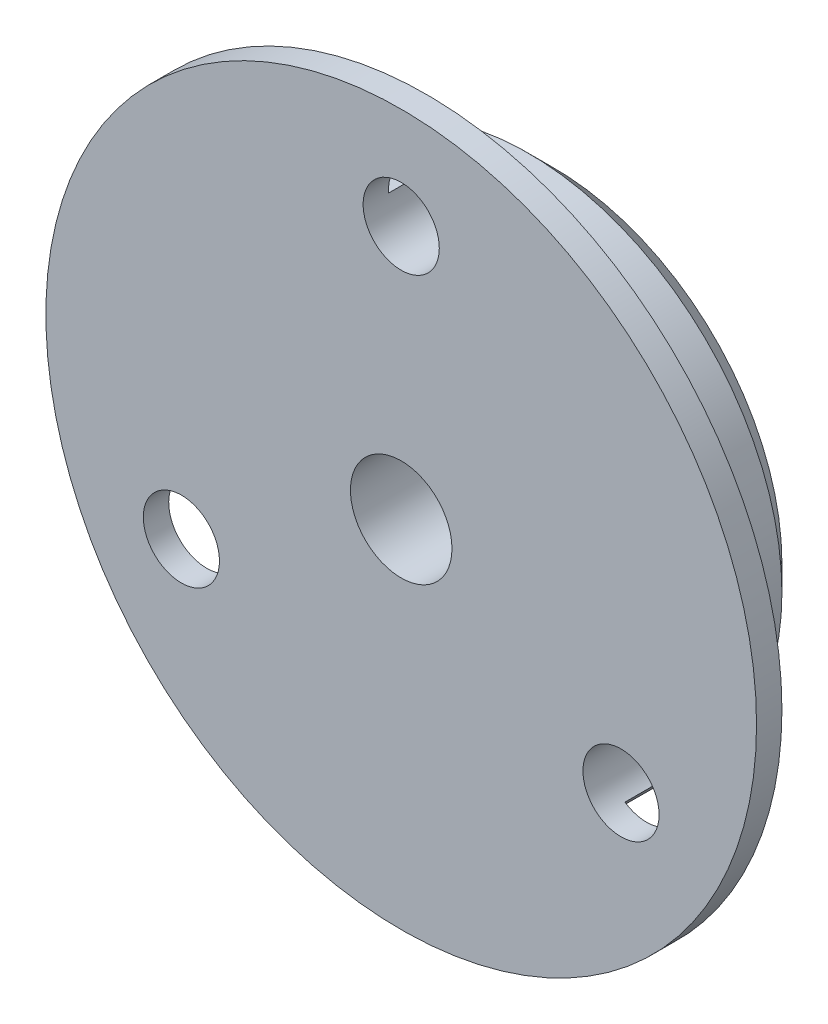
ISO-10303-21;
HEADER;
FILE_DESCRIPTION(('STEP AP214'),'2;1');
FILE_NAME('part.step','',(''),(''),'','','');
FILE_SCHEMA(('AUTOMOTIVE_DESIGN { 1 0 10303 214 1 1 1 1 }'));
ENDSEC;
DATA;
#1=APPLICATION_CONTEXT('core data for automotive mechanical design processes');
#2=APPLICATION_PROTOCOL_DEFINITION('international standard','automotive_design',2000,#1);
#3=PRODUCT_CONTEXT('',#1,'mechanical');
#4=PRODUCT('Part','Part','',(#3));
#5=PRODUCT_RELATED_PRODUCT_CATEGORY('part','',(#4));
#6=PRODUCT_DEFINITION_FORMATION('','',#4);
#7=PRODUCT_DEFINITION_CONTEXT('part definition',#1,'design');
#8=PRODUCT_DEFINITION('design','',#6,#7);
#9=PRODUCT_DEFINITION_SHAPE('','',#8);
#10=(LENGTH_UNIT() NAMED_UNIT(*) SI_UNIT(.MILLI.,.METRE.));
#11=(NAMED_UNIT(*) PLANE_ANGLE_UNIT() SI_UNIT($,.RADIAN.));
#12=(NAMED_UNIT(*) SI_UNIT($,.STERADIAN.) SOLID_ANGLE_UNIT());
#13=UNCERTAINTY_MEASURE_WITH_UNIT(LENGTH_MEASURE(1.E-05),#10,'distance_accuracy_value','');
#14=(GEOMETRIC_REPRESENTATION_CONTEXT(3) GLOBAL_UNCERTAINTY_ASSIGNED_CONTEXT((#13)) GLOBAL_UNIT_ASSIGNED_CONTEXT((#10,
#11,#12)) REPRESENTATION_CONTEXT('',''));
#15=CARTESIAN_POINT('',(0.,0.,0.));
#16=DIRECTION('',(0.,0.,1.));
#17=DIRECTION('',(1.,0.,0.));
#18=AXIS2_PLACEMENT_3D('',#15,#16,#17);
#19=CARTESIAN_POINT('',(0.,0.,5.));
#20=DIRECTION('',(0.,0.,-1.));
#21=DIRECTION('',(-1.,0.,0.));
#22=AXIS2_PLACEMENT_3D('',#19,#20,#21);
#23=CYLINDRICAL_SURFACE('',#22,10.);
#24=CARTESIAN_POINT('',(0.,0.,1.));
#25=DIRECTION('',(0.,0.,1.));
#26=DIRECTION('',(1.,0.,0.));
#27=AXIS2_PLACEMENT_3D('',#24,#25,#26);
#28=CIRCLE('',#27,10.);
#29=CARTESIAN_POINT('',(10.,0.,1.));
#30=VERTEX_POINT('',#29);
#31=EDGE_CURVE('E139',#30,#30,#28,.T.);
#32=ORIENTED_EDGE('',*,*,#31,.T.);
#33=EDGE_LOOP('',(#32));
#34=FACE_BOUND('',#33,.T.);
#35=CARTESIAN_POINT('',(0.,0.,3.));
#36=DIRECTION('',(0.,0.,1.));
#37=DIRECTION('',(1.,0.,0.));
#38=AXIS2_PLACEMENT_3D('',#35,#36,#37);
#39=CIRCLE('',#38,10.);
#40=CARTESIAN_POINT('',(-9.3107138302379,-3.6483705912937,3.));
#41=VERTEX_POINT('',#40);
#42=CARTESIAN_POINT('',(-7.81493852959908,-6.23912940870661,3.));
#43=VERTEX_POINT('',#42);
#44=EDGE_CURVE('E11',#41,#43,#39,.T.);
#45=ORIENTED_EDGE('',*,*,#44,.F.);
#46=DIRECTION('',(0.,0.,1.));
#47=VECTOR('',#46,1.);
#48=CARTESIAN_POINT('',(-9.3107138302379,-3.6483705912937,4.5));
#49=LINE('',#48,#47);
#50=CARTESIAN_POINT('',(-9.3107138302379,-3.6483705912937,5.));
#51=VERTEX_POINT('',#50);
#52=EDGE_CURVE('E78',#41,#51,#49,.T.);
#53=ORIENTED_EDGE('',*,*,#52,.T.);
#54=CARTESIAN_POINT('',(0.,0.,5.));
#55=DIRECTION('',(0.,0.,1.));
#56=DIRECTION('',(1.,0.,0.));
#57=AXIS2_PLACEMENT_3D('',#54,#55,#56);
#58=CIRCLE('',#57,10.);
#59=CARTESIAN_POINT('',(-1.49577530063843,9.8875,5.));
#60=VERTEX_POINT('',#59);
#61=EDGE_CURVE('E137',#60,#51,#58,.T.);
#62=ORIENTED_EDGE('',*,*,#61,.F.);
#63=DIRECTION('',(0.,0.,1.));
#64=VECTOR('',#63,1.);
#65=CARTESIAN_POINT('',(-1.49577530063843,9.8875,4.5));
#66=LINE('',#65,#64);
#67=CARTESIAN_POINT('',(-1.49577530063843,9.8875,3.));
#68=VERTEX_POINT('',#67);
#69=EDGE_CURVE('E118',#60,#68,#66,.F.);
#70=ORIENTED_EDGE('',*,*,#69,.T.);
#71=CARTESIAN_POINT('',(0.,0.,3.));
#72=DIRECTION('',(0.,0.,1.));
#73=DIRECTION('',(1.,0.,0.));
#74=AXIS2_PLACEMENT_3D('',#71,#72,#73);
#75=CIRCLE('',#74,10.);
#76=CARTESIAN_POINT('',(1.49577530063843,9.8875,3.));
#77=VERTEX_POINT('',#76);
#78=EDGE_CURVE('E145',#77,#68,#75,.T.);
#79=ORIENTED_EDGE('',*,*,#78,.F.);
#80=DIRECTION('',(0.,0.,1.));
#81=VECTOR('',#80,1.);
#82=CARTESIAN_POINT('',(1.49577530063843,9.8875,4.5));
#83=LINE('',#82,#81);
#84=CARTESIAN_POINT('',(1.49577530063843,9.8875,5.));
#85=VERTEX_POINT('',#84);
#86=EDGE_CURVE('E121',#77,#85,#83,.T.);
#87=ORIENTED_EDGE('',*,*,#86,.T.);
#88=CARTESIAN_POINT('',(9.31071383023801,-3.64837059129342,5.));
#89=VERTEX_POINT('',#88);
#90=EDGE_CURVE('E136',#89,#85,#58,.T.);
#91=ORIENTED_EDGE('',*,*,#90,.F.);
#92=DIRECTION('',(0.,0.,1.));
#93=VECTOR('',#92,1.);
#94=CARTESIAN_POINT('',(9.310713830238,-3.64837059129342,4.5));
#95=LINE('',#94,#93);
#96=CARTESIAN_POINT('',(9.31071383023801,-3.64837059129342,3.));
#97=VERTEX_POINT('',#96);
#98=EDGE_CURVE('E48',#89,#97,#95,.F.);
#99=ORIENTED_EDGE('',*,*,#98,.T.);
#100=CARTESIAN_POINT('',(0.,0.,3.));
#101=DIRECTION('',(0.,0.,1.));
#102=DIRECTION('',(1.,0.,0.));
#103=AXIS2_PLACEMENT_3D('',#100,#101,#102);
#104=CIRCLE('',#103,10.);
#105=CARTESIAN_POINT('',(7.81493852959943,-6.23912940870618,3.));
#106=VERTEX_POINT('',#105);
#107=EDGE_CURVE('E33',#106,#97,#104,.T.);
#108=ORIENTED_EDGE('',*,*,#107,.F.);
#109=DIRECTION('',(0.,0.,1.));
#110=VECTOR('',#109,1.);
#111=CARTESIAN_POINT('',(7.81493852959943,-6.23912940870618,4.5));
#112=LINE('',#111,#110);
#113=CARTESIAN_POINT('',(7.81493852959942,-6.23912940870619,5.));
#114=VERTEX_POINT('',#113);
#115=EDGE_CURVE('E107',#106,#114,#112,.T.);
#116=ORIENTED_EDGE('',*,*,#115,.T.);
#117=CARTESIAN_POINT('',(-7.81493852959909,-6.23912940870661,5.));
#118=VERTEX_POINT('',#117);
#119=EDGE_CURVE('E95',#118,#114,#58,.T.);
#120=ORIENTED_EDGE('',*,*,#119,.F.);
#121=DIRECTION('',(0.,0.,1.));
#122=VECTOR('',#121,1.);
#123=CARTESIAN_POINT('',(-7.81493852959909,-6.23912940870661,4.5));
#124=LINE('',#123,#122);
#125=EDGE_CURVE('E40',#118,#43,#124,.F.);
#126=ORIENTED_EDGE('',*,*,#125,.T.);
#127=EDGE_LOOP('',(#45,#53,#62,#70,#79,#87,#91,#99,#108,#116,#120,#126));
#128=FACE_BOUND('',#127,.T.);
#129=ADVANCED_FACE('F26',(#34,#128),#23,.T.);
#130=CARTESIAN_POINT('',(0.,0.,0.));
#131=DIRECTION('',(0.,0.,1.));
#132=DIRECTION('',(1.,0.,0.));
#133=AXIS2_PLACEMENT_3D('',#130,#131,#132);
#134=PLANE('',#133);
#135=CARTESIAN_POINT('',(0.,0.,0.));
#136=DIRECTION('',(0.,0.,1.));
#137=DIRECTION('',(1.,0.,0.));
#138=AXIS2_PLACEMENT_3D('',#135,#136,#137);
#139=CIRCLE('',#138,2.);
#140=CARTESIAN_POINT('',(2.,0.,0.));
#141=VERTEX_POINT('',#140);
#142=EDGE_CURVE('E127',#141,#141,#139,.T.);
#143=ORIENTED_EDGE('',*,*,#142,.T.);
#144=EDGE_LOOP('',(#143));
#145=FACE_BOUND('',#144,.T.);
#146=CARTESIAN_POINT('',(0.,0.,0.));
#147=DIRECTION('',(0.,0.,1.));
#148=DIRECTION('',(1.,0.,0.));
#149=AXIS2_PLACEMENT_3D('',#146,#147,#148);
#150=CIRCLE('',#149,8.99999999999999);
#151=CARTESIAN_POINT('',(8.99999999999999,0.,0.));
#152=VERTEX_POINT('',#151);
#153=EDGE_CURVE('E142',#152,#152,#150,.F.);
#154=ORIENTED_EDGE('',*,*,#153,.T.);
#155=EDGE_LOOP('',(#154));
#156=FACE_BOUND('',#155,.T.);
#157=ADVANCED_FACE('F175',(#145,#156),#134,.F.);
#158=CARTESIAN_POINT('',(0.,0.,1.));
#159=DIRECTION('',(0.,0.,1.));
#160=DIRECTION('',(1.,0.,0.));
#161=AXIS2_PLACEMENT_3D('',#158,#159,#160);
#162=CONICAL_SURFACE('',#161,10.,0.785398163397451);
#163=ORIENTED_EDGE('',*,*,#153,.F.);
#164=EDGE_LOOP('',(#163));
#165=FACE_BOUND('',#164,.T.);
#166=ORIENTED_EDGE('',*,*,#31,.F.);
#167=EDGE_LOOP('',(#166));
#168=FACE_BOUND('',#167,.T.);
#169=ADVANCED_FACE('F181',(#165,#168),#162,.T.);
#170=CARTESIAN_POINT('',(0.,0.,5.));
#171=DIRECTION('',(0.,0.,1.));
#172=DIRECTION('',(1.,0.,0.));
#173=AXIS2_PLACEMENT_3D('',#170,#171,#172);
#174=PLANE('',#173);
#175=CARTESIAN_POINT('',(0.,0.,5.));
#176=DIRECTION('',(0.,0.,1.));
#177=DIRECTION('',(1.,0.,0.));
#178=AXIS2_PLACEMENT_3D('',#175,#176,#177);
#179=CIRCLE('',#178,14.);
#180=CARTESIAN_POINT('',(14.,0.,5.));
#181=VERTEX_POINT('',#180);
#182=EDGE_CURVE('E130',#181,#181,#179,.T.);
#183=ORIENTED_EDGE('',*,*,#182,.F.);
#184=EDGE_LOOP('',(#183));
#185=FACE_BOUND('',#184,.T.);
#186=ORIENTED_EDGE('',*,*,#61,.T.);
#187=CARTESIAN_POINT('',(-8.66025403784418,-5.00000000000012,5.));
#188=DIRECTION('',(0.,0.,1.));
#189=DIRECTION('',(1.,0.,0.));
#190=AXIS2_PLACEMENT_3D('',#187,#188,#189);
#191=CIRCLE('',#190,1.50000000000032);
#192=EDGE_CURVE('E82',#51,#118,#191,.T.);
#193=ORIENTED_EDGE('',*,*,#192,.T.);
#194=ORIENTED_EDGE('',*,*,#119,.T.);
#195=CARTESIAN_POINT('',(8.6602540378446,-4.99999999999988,5.));
#196=DIRECTION('',(0.,0.,1.));
#197=DIRECTION('',(1.,0.,0.));
#198=AXIS2_PLACEMENT_3D('',#195,#196,#197);
#199=CIRCLE('',#198,1.50000000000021);
#200=EDGE_CURVE('E104',#114,#89,#199,.T.);
#201=ORIENTED_EDGE('',*,*,#200,.T.);
#202=ORIENTED_EDGE('',*,*,#90,.T.);
#203=CARTESIAN_POINT('',(0.,10.,5.));
#204=DIRECTION('',(0.,0.,1.));
#205=DIRECTION('',(1.,0.,0.));
#206=AXIS2_PLACEMENT_3D('',#203,#204,#205);
#207=CIRCLE('',#206,1.5);
#208=EDGE_CURVE('E115',#85,#60,#207,.T.);
#209=ORIENTED_EDGE('',*,*,#208,.T.);
#210=EDGE_LOOP('',(#186,#193,#194,#201,#202,#209));
#211=FACE_BOUND('',#210,.T.);
#212=ADVANCED_FACE('F154',(#185,#211),#174,.F.);
#213=CARTESIAN_POINT('',(0.,0.,6.));
#214=DIRECTION('',(0.,0.,-1.));
#215=DIRECTION('',(-1.,0.,0.));
#216=AXIS2_PLACEMENT_3D('',#213,#214,#215);
#217=CYLINDRICAL_SURFACE('',#216,14.);
#218=CARTESIAN_POINT('',(0.,0.,6.));
#219=DIRECTION('',(0.,0.,1.));
#220=DIRECTION('',(1.,0.,0.));
#221=AXIS2_PLACEMENT_3D('',#218,#219,#220);
#222=CIRCLE('',#221,14.);
#223=CARTESIAN_POINT('',(14.,0.,6.));
#224=VERTEX_POINT('',#223);
#225=EDGE_CURVE('E133',#224,#224,#222,.T.);
#226=ORIENTED_EDGE('',*,*,#225,.F.);
#227=EDGE_LOOP('',(#226));
#228=FACE_BOUND('',#227,.T.);
#229=ORIENTED_EDGE('',*,*,#182,.T.);
#230=EDGE_LOOP('',(#229));
#231=FACE_BOUND('',#230,.T.);
#232=ADVANCED_FACE('F191',(#228,#231),#217,.T.);
#233=CARTESIAN_POINT('',(0.,0.,6.));
#234=DIRECTION('',(0.,0.,1.));
#235=DIRECTION('',(1.,0.,0.));
#236=AXIS2_PLACEMENT_3D('',#233,#234,#235);
#237=PLANE('',#236);
#238=CARTESIAN_POINT('',(-8.66025403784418,-5.00000000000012,6.));
#239=DIRECTION('',(0.,0.,1.));
#240=DIRECTION('',(1.,0.,0.));
#241=AXIS2_PLACEMENT_3D('',#238,#239,#240);
#242=CIRCLE('',#241,1.50000000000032);
#243=CARTESIAN_POINT('',(-7.16025403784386,-5.00000000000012,6.));
#244=VERTEX_POINT('',#243);
#245=EDGE_CURVE('E91',#244,#244,#242,.T.);
#246=ORIENTED_EDGE('',*,*,#245,.F.);
#247=EDGE_LOOP('',(#246));
#248=FACE_BOUND('',#247,.T.);
#249=CARTESIAN_POINT('',(8.6602540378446,-4.99999999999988,6.));
#250=DIRECTION('',(0.,0.,1.));
#251=DIRECTION('',(1.,0.,0.));
#252=AXIS2_PLACEMENT_3D('',#249,#250,#251);
#253=CIRCLE('',#252,1.50000000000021);
#254=CARTESIAN_POINT('',(10.1602540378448,-4.99999999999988,6.));
#255=VERTEX_POINT('',#254);
#256=EDGE_CURVE('E87',#255,#255,#253,.T.);
#257=ORIENTED_EDGE('',*,*,#256,.F.);
#258=EDGE_LOOP('',(#257));
#259=FACE_BOUND('',#258,.T.);
#260=CARTESIAN_POINT('',(0.,10.,6.));
#261=DIRECTION('',(0.,0.,1.));
#262=DIRECTION('',(1.,0.,0.));
#263=AXIS2_PLACEMENT_3D('',#260,#261,#262);
#264=CIRCLE('',#263,1.5);
#265=CARTESIAN_POINT('',(1.5,10.,6.));
#266=VERTEX_POINT('',#265);
#267=EDGE_CURVE('E109',#266,#266,#264,.T.);
#268=ORIENTED_EDGE('',*,*,#267,.F.);
#269=EDGE_LOOP('',(#268));
#270=FACE_BOUND('',#269,.T.);
#271=CARTESIAN_POINT('',(0.,0.,6.));
#272=DIRECTION('',(0.,0.,1.));
#273=DIRECTION('',(1.,0.,0.));
#274=AXIS2_PLACEMENT_3D('',#271,#272,#273);
#275=CIRCLE('',#274,2.);
#276=CARTESIAN_POINT('',(2.,0.,6.));
#277=VERTEX_POINT('',#276);
#278=EDGE_CURVE('E124',#277,#277,#275,.T.);
#279=ORIENTED_EDGE('',*,*,#278,.F.);
#280=EDGE_LOOP('',(#279));
#281=FACE_BOUND('',#280,.T.);
#282=ORIENTED_EDGE('',*,*,#225,.T.);
#283=EDGE_LOOP('',(#282));
#284=FACE_BOUND('',#283,.T.);
#285=ADVANCED_FACE('F170',(#248,#259,#270,#281,#284),#237,.T.);
#286=CARTESIAN_POINT('',(0.,0.,0.));
#287=DIRECTION('',(0.,0.,1.));
#288=DIRECTION('',(1.,0.,0.));
#289=AXIS2_PLACEMENT_3D('',#286,#287,#288);
#290=CYLINDRICAL_SURFACE('',#289,2.);
#291=ORIENTED_EDGE('',*,*,#142,.F.);
#292=EDGE_LOOP('',(#291));
#293=FACE_BOUND('',#292,.T.);
#294=ORIENTED_EDGE('',*,*,#278,.T.);
#295=EDGE_LOOP('',(#294));
#296=FACE_BOUND('',#295,.T.);
#297=ADVANCED_FACE('F161',(#293,#296),#290,.F.);
#298=CARTESIAN_POINT('',(0.,10.,3.));
#299=DIRECTION('',(0.,0.,1.));
#300=DIRECTION('',(1.,0.,0.));
#301=AXIS2_PLACEMENT_3D('',#298,#299,#300);
#302=PLANE('',#301);
#303=ORIENTED_EDGE('',*,*,#78,.T.);
#304=CARTESIAN_POINT('',(0.,10.,3.));
#305=DIRECTION('',(0.,0.,1.));
#306=DIRECTION('',(1.,0.,0.));
#307=AXIS2_PLACEMENT_3D('',#304,#305,#306);
#308=CIRCLE('',#307,1.5);
#309=EDGE_CURVE('E112',#68,#77,#308,.T.);
#310=ORIENTED_EDGE('',*,*,#309,.T.);
#311=EDGE_LOOP('',(#303,#310));
#312=FACE_BOUND('',#311,.T.);
#313=ADVANCED_FACE('F159',(#312),#302,.T.);
#314=CARTESIAN_POINT('',(0.,10.,3.));
#315=DIRECTION('',(0.,0.,1.));
#316=DIRECTION('',(1.,0.,0.));
#317=AXIS2_PLACEMENT_3D('',#314,#315,#316);
#318=CYLINDRICAL_SURFACE('',#317,1.5);
#319=ORIENTED_EDGE('',*,*,#267,.T.);
#320=EDGE_LOOP('',(#319));
#321=FACE_BOUND('',#320,.T.);
#322=ORIENTED_EDGE('',*,*,#309,.F.);
#323=ORIENTED_EDGE('',*,*,#69,.F.);
#324=ORIENTED_EDGE('',*,*,#208,.F.);
#325=ORIENTED_EDGE('',*,*,#86,.F.);
#326=EDGE_LOOP('',(#322,#323,#324,#325));
#327=FACE_BOUND('',#326,.T.);
#328=ADVANCED_FACE('F157',(#321,#327),#318,.F.);
#329=CARTESIAN_POINT('',(8.6602540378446,-4.99999999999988,3.));
#330=DIRECTION('',(0.,0.,1.));
#331=DIRECTION('',(1.,0.,0.));
#332=AXIS2_PLACEMENT_3D('',#329,#330,#331);
#333=PLANE('',#332);
#334=ORIENTED_EDGE('',*,*,#107,.T.);
#335=CARTESIAN_POINT('',(8.6602540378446,-4.99999999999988,3.));
#336=DIRECTION('',(0.,0.,1.));
#337=DIRECTION('',(1.,0.,0.));
#338=AXIS2_PLACEMENT_3D('',#335,#336,#337);
#339=CIRCLE('',#338,1.50000000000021);
#340=EDGE_CURVE('E101',#97,#106,#339,.T.);
#341=ORIENTED_EDGE('',*,*,#340,.T.);
#342=EDGE_LOOP('',(#334,#341));
#343=FACE_BOUND('',#342,.T.);
#344=ADVANCED_FACE('F148',(#343),#333,.T.);
#345=CARTESIAN_POINT('',(8.6602540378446,-4.99999999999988,3.));
#346=DIRECTION('',(0.,0.,1.));
#347=DIRECTION('',(1.,0.,0.));
#348=AXIS2_PLACEMENT_3D('',#345,#346,#347);
#349=CYLINDRICAL_SURFACE('',#348,1.50000000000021);
#350=ORIENTED_EDGE('',*,*,#256,.T.);
#351=EDGE_LOOP('',(#350));
#352=FACE_BOUND('',#351,.T.);
#353=ORIENTED_EDGE('',*,*,#340,.F.);
#354=ORIENTED_EDGE('',*,*,#98,.F.);
#355=ORIENTED_EDGE('',*,*,#200,.F.);
#356=ORIENTED_EDGE('',*,*,#115,.F.);
#357=EDGE_LOOP('',(#353,#354,#355,#356));
#358=FACE_BOUND('',#357,.T.);
#359=ADVANCED_FACE('F149',(#352,#358),#349,.F.);
#360=CARTESIAN_POINT('',(-8.66025403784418,-5.00000000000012,3.));
#361=DIRECTION('',(0.,0.,1.));
#362=DIRECTION('',(1.,0.,0.));
#363=AXIS2_PLACEMENT_3D('',#360,#361,#362);
#364=PLANE('',#363);
#365=ORIENTED_EDGE('',*,*,#44,.T.);
#366=CARTESIAN_POINT('',(-8.66025403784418,-5.00000000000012,3.));
#367=DIRECTION('',(0.,0.,1.));
#368=DIRECTION('',(1.,0.,0.));
#369=AXIS2_PLACEMENT_3D('',#366,#367,#368);
#370=CIRCLE('',#369,1.50000000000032);
#371=EDGE_CURVE('E81',#43,#41,#370,.T.);
#372=ORIENTED_EDGE('',*,*,#371,.T.);
#373=EDGE_LOOP('',(#365,#372));
#374=FACE_BOUND('',#373,.T.);
#375=ADVANCED_FACE('F90',(#374),#364,.T.);
#376=CARTESIAN_POINT('',(-8.66025403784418,-5.00000000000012,3.));
#377=DIRECTION('',(0.,0.,1.));
#378=DIRECTION('',(1.,0.,0.));
#379=AXIS2_PLACEMENT_3D('',#376,#377,#378);
#380=CYLINDRICAL_SURFACE('',#379,1.50000000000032);
#381=ORIENTED_EDGE('',*,*,#245,.T.);
#382=EDGE_LOOP('',(#381));
#383=FACE_BOUND('',#382,.T.);
#384=ORIENTED_EDGE('',*,*,#371,.F.);
#385=ORIENTED_EDGE('',*,*,#125,.F.);
#386=ORIENTED_EDGE('',*,*,#192,.F.);
#387=ORIENTED_EDGE('',*,*,#52,.F.);
#388=EDGE_LOOP('',(#384,#385,#386,#387));
#389=FACE_BOUND('',#388,.T.);
#390=ADVANCED_FACE('F80',(#383,#389),#380,.F.);
#391=CLOSED_SHELL('',(#129,#157,#169,#212,#232,#285,#297,#313,#328,#344,#359,#375,#390));
#392=MANIFOLD_SOLID_BREP('B2',#391);
#393=ADVANCED_BREP_SHAPE_REPRESENTATION('',(#18,#392),#14);
#394=SHAPE_DEFINITION_REPRESENTATION(#9,#393);
ENDSEC;
END-ISO-10303-21;
